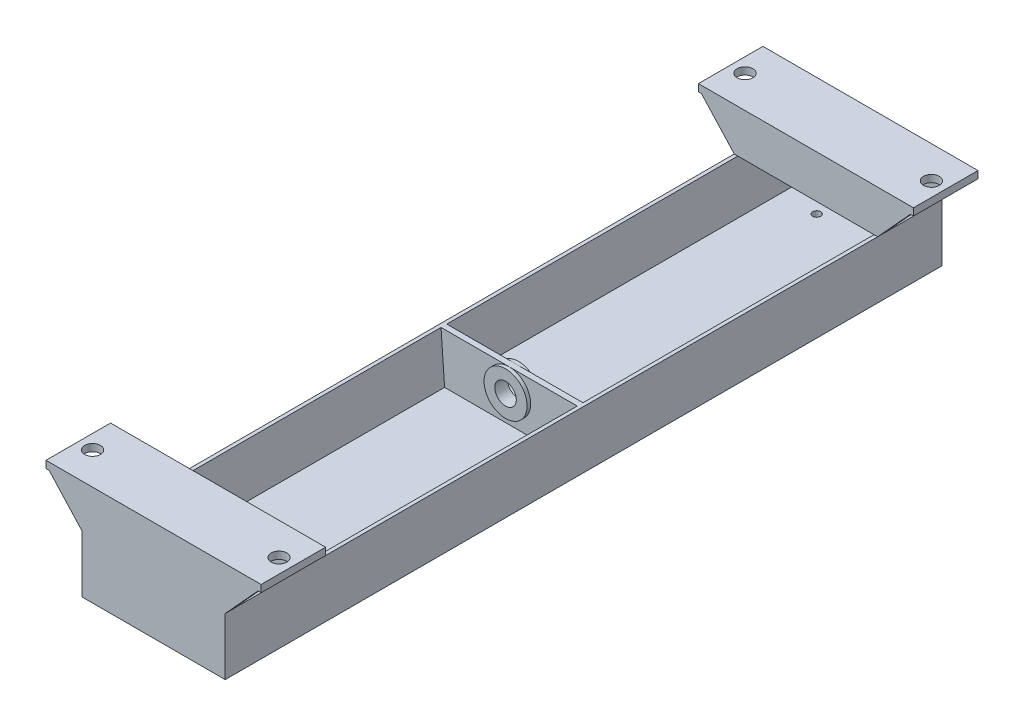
from build123d import *

# Parameters (mm, degrees)
EXTRUDE1_DEPTH           = 317.5
EXTRUDE6_DEPTH           = 2.54
SKETCH10_R               = 9.525
CUT_EXTRUDE3_DEPTH       = 331.209769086
EXTRUDE8_START           = 3.175
SKETCH14_R               = 19.05
SKETCH14_R_2             = 9.525
EXTRUDE8_DEPTH           = 3.175
SKETCH15_R               = 3.556
CUT_EXTRUDE6_DEPTH       = 328.748592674
EXTRUDE9_DEPTH           = 6.35
EXTRUDE10_DEPTH          = 6.35
LPATTERN1_COUNT          = 2
LPATTERN1_PITCH          = 50.8
SKETCH18_W               = 57.15
SKETCH18_H               = 3.338946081
EXTRUDE11_DEPTH          = 6.35
MIRROR11_COPY_1_DEPTH    = 6.35
MIRROR11_COPY_2_SKETCH_W = 57.15
MIRROR11_COPY_2_SKETCH_H = 3.338946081
MIRROR11_COPY_2_DEPTH    = 6.35
SKETCH19_W               = 190.5
SKETCH19_H               = 57.15
EXTRUDE12_DEPTH          = 6.35
SKETCH20_R               = 6.985
CUT_EXTRUDE7_DEPTH       = 344.193855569
MIRROR14_COPY_1_SKETCH_R = 6.985
MIRROR14_COPY_1_DEPTH    = 344.193855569


with BuildPart() as part:
    # Sketch1 → Extrude1 (new, symmetric)
    with BuildSketch(Plane.XY):
        Polygon((-63.5, 50.8), (-63.5, 0), (63.5, 0), (63.5, 50.8), (60.325, 50.8), (57.15, 6.35), (-57.15, 6.35), (-60.325, 50.8), align=None)
    extrude(amount=EXTRUDE1_DEPTH, both=True)

    # Sketch9 → Extrude6 (add, symmetric)
    with BuildSketch(Plane.XY):
        Polygon((-60.325, 50.8), (60.325, 50.8), (57.15, 6.35), (-57.15, 6.35), align=None)
    extrude(amount=EXTRUDE6_DEPTH, both=True)

    # Sketch10 → Cut-Extrude3 (cut, through all)
    with BuildSketch(Plane.XY.offset(2.54)):
        with Locations((0, 31.75)):
            Circle(SKETCH10_R)
    extrude(amount=-CUT_EXTRUDE3_DEPTH, mode=Mode.SUBTRACT)

    # Sketch14 → Extrude8 (add)
    with BuildSketch(Plane.XY.offset(2.54).offset(EXTRUDE8_START)):
        with Locations(Location((0, 31.75, 0), (0, 0, 90))):
            Circle(SKETCH14_R)
        with Locations((0, 31.75)):
            Circle(SKETCH14_R_2, mode=Mode.SUBTRACT)
    extrude8 = extrude(amount=-EXTRUDE8_DEPTH)

    # Mirror8: Extrude8 across plane
    add(extrude8.mirror(Plane.XY))

    # Sketch15 → Cut-Extrude6 (cut, through all)
    with BuildSketch(Plane.XZ):
        with Locations((-25.4, 295.275)):
            Circle(SKETCH15_R)
        with Locations((25.4, 295.275)):
            Circle(SKETCH15_R)
        with Locations((25.4, -295.275)):
            Circle(SKETCH15_R)
        with Locations((-25.4, -295.275)):
            Circle(SKETCH15_R)
    extrude(amount=-CUT_EXTRUDE6_DEPTH, mode=Mode.SUBTRACT)

    # Sketch16 → Extrude9 (add)
    with BuildSketch(Plane(origin=(0, 0, -317.5), x_dir=(-1, 0, 0), z_dir=(0, 0, -1))):
        Polygon((60.325, 50.8), (57.15, 6.35), (-57.15, 6.35), (-60.325, 50.8), align=None)
    extrude9 = extrude(amount=-EXTRUDE9_DEPTH)

    # Mirror9: Extrude9 across plane
    add(extrude9.mirror(Plane.XY))

    # Sketch17 → Extrude10 (add)
    with BuildSketch(Plane.XY.offset(317.5)):
        Polygon((-63.5, 50.8), (-95.25, 85.561053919), (-95.25, 88.9), (95.25, 88.9), (95.25, 85.561053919), (63.5, 50.8), align=None)
    extrude10 = extrude(amount=-EXTRUDE10_DEPTH)

    # LPattern1: Extrude10 ×2
    with Locations(*[(0, 0, -i * LPATTERN1_PITCH) for i in range(1, LPATTERN1_COUNT)]):
        add(extrude10)

    # Sketch18 → Extrude11 (add)
    with BuildSketch(Plane(origin=(95.25, 0, 0), x_dir=(0, 0, -1), z_dir=(1, 0, 0))):
        with Locations((-288.925, 87.230526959)):
            Rectangle(SKETCH18_W, SKETCH18_H)
    extrude11 = extrude(amount=-EXTRUDE11_DEPTH)

    # Mirror10: Extrude11 across plane
    add(extrude11.mirror(Plane(origin=(0, 0, 0), x_dir=(0, 0, 1), z_dir=(1, 0, 0))))

    # Mirror11: Extrude10, Extrude11 across plane
    add(extrude10.mirror(Plane.XY))
    add(extrude11.mirror(Plane.XY))

    # Mirror11 copy 1 sketch → Mirror11 copy 1 (add)
    with BuildSketch(Plane(origin=(0, 0, -266.7), x_dir=(1, 0, 0), z_dir=(0, 0, -1))):
        Polygon((-63.5, -50.8), (-95.25, -85.561053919), (-95.25, -88.9), (95.25, -88.9), (95.25, -85.561053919), (63.5, -50.8), align=None)
    extrude(amount=-MIRROR11_COPY_1_DEPTH)

    # Mirror11 copy 2 sketch → Mirror11 copy 2 (add)
    with BuildSketch(Plane.ZY.offset(95.25)):
        with Locations((-288.925, 87.230526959)):
            Rectangle(MIRROR11_COPY_2_SKETCH_W, MIRROR11_COPY_2_SKETCH_H)
    extrude(amount=-MIRROR11_COPY_2_DEPTH)

    # Sketch19 → Extrude12 (add)
    with BuildSketch(Plane(origin=(0, 88.9, 0), x_dir=(-1, 0, 0), z_dir=(0, 1, 0))):
        with Locations((0, -288.925)):
            Rectangle(SKETCH19_W, SKETCH19_H)
    extrude12 = extrude(amount=-EXTRUDE12_DEPTH)

    # Mirror12: Extrude12 across plane
    add(extrude12.mirror(Plane.XY))

    # Sketch20 → Cut-Extrude7 (cut, through all)
    with BuildSketch(Plane(origin=(0, 88.9, 0), x_dir=(-1, 0, 0), z_dir=(0, 1, 0))):
        with Locations((82.55, -288.925)):
            Circle(SKETCH20_R)
    cut_extrude7 = extrude(amount=-CUT_EXTRUDE7_DEPTH, mode=Mode.SUBTRACT)

    # Mirror13: Cut-Extrude7 across plane
    add(cut_extrude7.mirror(Plane(origin=(0, 0, 0), x_dir=(0, 0, 1), z_dir=(1, 0, 0))), mode=Mode.SUBTRACT)

    # Mirror14: Cut-Extrude7 across plane
    add(cut_extrude7.mirror(Plane.XY), mode=Mode.SUBTRACT)

    # Mirror14 copy 1 sketch → Mirror14 copy 1 (cut, through all)
    with BuildSketch(Plane(origin=(0, 88.9, 0), x_dir=(1, 0, 0), z_dir=(0, 1, 0))):
        with Locations((82.55, -288.925)):
            Circle(MIRROR14_COPY_1_SKETCH_R)
    extrude(amount=-MIRROR14_COPY_1_DEPTH, mode=Mode.SUBTRACT)


solid = part.part
